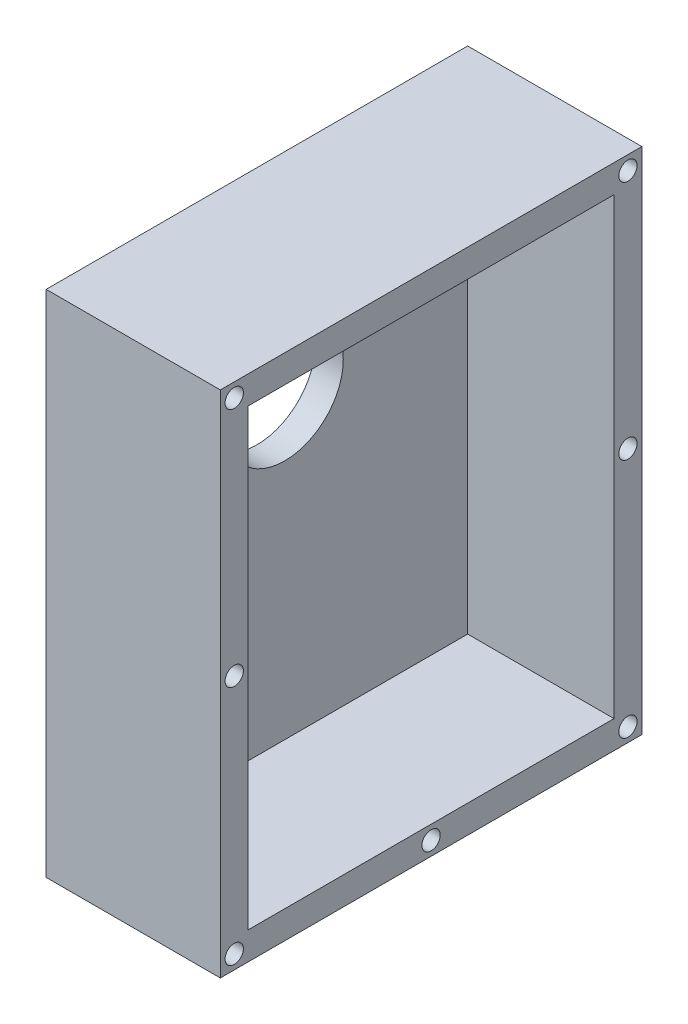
from build123d import *

# Parameters (mm, degrees)
SKETCH3_W               = 39.37
SKETCH3_H               = 31.75
BOSS_EXTRUDE2_DEPTH     = 12.7
SHELL13_T               = 2.413
CUT_EXTRUDE1_DEPTH      = 56.445645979
CUT_EXTRUDE1_DEPTH_BACK = 56.445645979
SKETCH7_R               = 5.08
SKETCH9_R               = 0.79375
CUT_EXTRUDE2_DEPTH      = 7.62


with BuildPart() as part:
    # Sketch3 → Boss-Extrude2 (new body)
    with BuildSketch(Plane.YZ):
        with Locations((19.685, 15.875)):
            Rectangle(SKETCH3_W, SKETCH3_H)
    extrude(amount=BOSS_EXTRUDE2_DEPTH)

    # Shell13
    shell13_openings = [part.faces().sort_by_distance(p)[0] for p in [
        (12.7, 19.685, 15.875),
    ]]
    offset(amount=SHELL13_T, openings=shell13_openings, kind=Kind.INTERSECTION)

    # Sketch7 → Cut-Extrude1 (cut, two sides: drawn at the far end of the back side and taken through both)
    with BuildSketch(Plane(origin=(0, 0, 0), x_dir=(0, 0, -1), z_dir=(1, 0, 0)).offset(-CUT_EXTRUDE1_DEPTH_BACK)):
        with Locations((-15.875, 26.035)):
            Circle(SKETCH7_R)
    extrude(amount=CUT_EXTRUDE1_DEPTH + CUT_EXTRUDE1_DEPTH_BACK, mode=Mode.SUBTRACT)

    # Sketch9 → Cut-Extrude2 (cut)
    with BuildSketch(Plane.YZ.offset(12.7)):
        with Locations(Location((40.5765, 32.9565, 0), (0, 0, 270))):
            Circle(SKETCH9_R)
        with Locations(Location((19.685, 32.9565, 0), (0, 0, 270))):
            Circle(SKETCH9_R)
        with Locations(Location((-1.2065, 32.9565, 0), (0, 0, 270))):
            Circle(SKETCH9_R)
        with Locations(Location((-1.2065, 15.875, 0), (0, 0, 270))):
            Circle(SKETCH9_R)
        with Locations(Location((-1.2065, -1.2065, 0), (0, 0, 270))):
            Circle(SKETCH9_R)
        with Locations(Location((19.685, -1.2065, 0), (0, 0, 270))):
            Circle(SKETCH9_R)
        with Locations(Location((40.5765, -1.2065, 0), (0, 0, 270))):
            Circle(SKETCH9_R)
    extrude(amount=-CUT_EXTRUDE2_DEPTH, mode=Mode.SUBTRACT)


solid = part.part
